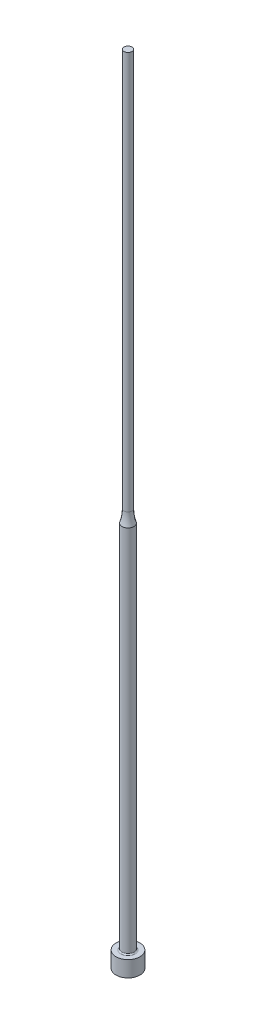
ISO-10303-21;
HEADER;
FILE_DESCRIPTION(('STEP AP214'),'2;1');
FILE_NAME('part.step','',(''),(''),'','','');
FILE_SCHEMA(('AUTOMOTIVE_DESIGN { 1 0 10303 214 1 1 1 1 }'));
ENDSEC;
DATA;
#1=APPLICATION_CONTEXT('core data for automotive mechanical design processes');
#2=APPLICATION_PROTOCOL_DEFINITION('international standard','automotive_design',2000,#1);
#3=PRODUCT_CONTEXT('',#1,'mechanical');
#4=PRODUCT('Part','Part','',(#3));
#5=PRODUCT_RELATED_PRODUCT_CATEGORY('part','',(#4));
#6=PRODUCT_DEFINITION_FORMATION('','',#4);
#7=PRODUCT_DEFINITION_CONTEXT('part definition',#1,'design');
#8=PRODUCT_DEFINITION('design','',#6,#7);
#9=PRODUCT_DEFINITION_SHAPE('','',#8);
#10=(LENGTH_UNIT() NAMED_UNIT(*) SI_UNIT(.MILLI.,.METRE.));
#11=(NAMED_UNIT(*) PLANE_ANGLE_UNIT() SI_UNIT($,.RADIAN.));
#12=(NAMED_UNIT(*) SI_UNIT($,.STERADIAN.) SOLID_ANGLE_UNIT());
#13=UNCERTAINTY_MEASURE_WITH_UNIT(LENGTH_MEASURE(1.E-05),#10,'distance_accuracy_value','');
#14=(GEOMETRIC_REPRESENTATION_CONTEXT(3) GLOBAL_UNCERTAINTY_ASSIGNED_CONTEXT((#13)) GLOBAL_UNIT_ASSIGNED_CONTEXT((#10,
#11,#12)) REPRESENTATION_CONTEXT('',''));
#15=CARTESIAN_POINT('',(0.,0.,0.));
#16=DIRECTION('',(0.,0.,1.));
#17=DIRECTION('',(1.,0.,0.));
#18=AXIS2_PLACEMENT_3D('',#15,#16,#17);
#19=CARTESIAN_POINT('',(1.00000000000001,200.,0.));
#20=DIRECTION('',(0.,-1.,0.));
#21=DIRECTION('',(1.,0.,0.));
#22=AXIS2_PLACEMENT_3D('',#19,#20,#21);
#23=PLANE('',#22);
#24=CARTESIAN_POINT('',(0.,200.,0.));
#25=DIRECTION('',(0.,1.,0.));
#26=DIRECTION('',(-1.,0.,0.));
#27=AXIS2_PLACEMENT_3D('',#24,#25,#26);
#28=CIRCLE('',#27,1.00000000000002);
#29=CARTESIAN_POINT('',(-1.00000000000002,200.,0.));
#30=VERTEX_POINT('',#29);
#31=EDGE_CURVE('E10',#30,#30,#28,.T.);
#32=ORIENTED_EDGE('',*,*,#31,.T.);
#33=EDGE_LOOP('',(#32));
#34=FACE_BOUND('',#33,.T.);
#35=ADVANCED_FACE('F30',(#34),#23,.F.);
#36=CARTESIAN_POINT('',(0.,200.,0.));
#37=DIRECTION('',(0.,1.,0.));
#38=DIRECTION('',(-1.,0.,0.));
#39=AXIS2_PLACEMENT_3D('',#36,#37,#38);
#40=CYLINDRICAL_SURFACE('',#39,1.00000000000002);
#41=ORIENTED_EDGE('',*,*,#31,.F.);
#42=EDGE_LOOP('',(#41));
#43=FACE_BOUND('',#42,.T.);
#44=CARTESIAN_POINT('',(0.,100.,0.));
#45=DIRECTION('',(0.,1.,0.));
#46=DIRECTION('',(-1.,0.,0.));
#47=AXIS2_PLACEMENT_3D('',#44,#45,#46);
#48=CIRCLE('',#47,1.00000000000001);
#49=CARTESIAN_POINT('',(-1.00000000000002,100.,0.));
#50=VERTEX_POINT('',#49);
#51=EDGE_CURVE('E36',#50,#50,#48,.T.);
#52=ORIENTED_EDGE('',*,*,#51,.T.);
#53=EDGE_LOOP('',(#52));
#54=FACE_BOUND('',#53,.T.);
#55=ADVANCED_FACE('F71',(#43,#54),#40,.T.);
#56=CARTESIAN_POINT('',(0.,100.,0.));
#57=DIRECTION('',(0.,1.,0.));
#58=DIRECTION('',(-1.,0.,0.));
#59=AXIS2_PLACEMENT_3D('',#56,#57,#58);
#60=TOROIDAL_SURFACE('',#59,11.,10.);
#61=ORIENTED_EDGE('',*,*,#51,.F.);
#62=EDGE_LOOP('',(#61));
#63=FACE_BOUND('',#62,.T.);
#64=CARTESIAN_POINT('',(0.,96.8775010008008,0.));
#65=DIRECTION('',(0.,1.,0.));
#66=DIRECTION('',(-1.,0.,0.));
#67=AXIS2_PLACEMENT_3D('',#64,#65,#66);
#68=CIRCLE('',#67,1.50000000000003);
#69=CARTESIAN_POINT('',(-1.50000000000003,96.8775010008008,0.));
#70=VERTEX_POINT('',#69);
#71=EDGE_CURVE('E40',#70,#70,#68,.T.);
#72=ORIENTED_EDGE('',*,*,#71,.T.);
#73=EDGE_LOOP('',(#72));
#74=FACE_BOUND('',#73,.T.);
#75=ADVANCED_FACE('F75',(#63,#74),#60,.F.);
#76=CARTESIAN_POINT('',(0.,200.,0.));
#77=DIRECTION('',(0.,1.,0.));
#78=DIRECTION('',(-1.,0.,0.));
#79=AXIS2_PLACEMENT_3D('',#76,#77,#78);
#80=CYLINDRICAL_SURFACE('',#79,1.50000000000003);
#81=ORIENTED_EDGE('',*,*,#71,.F.);
#82=EDGE_LOOP('',(#81));
#83=FACE_BOUND('',#82,.T.);
#84=CARTESIAN_POINT('',(0.,4.3,0.));
#85=DIRECTION('',(0.,1.,0.));
#86=DIRECTION('',(-1.,0.,0.));
#87=AXIS2_PLACEMENT_3D('',#84,#85,#86);
#88=CIRCLE('',#87,1.50000000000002);
#89=CARTESIAN_POINT('',(-1.50000000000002,4.3,0.));
#90=VERTEX_POINT('',#89);
#91=EDGE_CURVE('E44',#90,#90,#88,.T.);
#92=ORIENTED_EDGE('',*,*,#91,.T.);
#93=EDGE_LOOP('',(#92));
#94=FACE_BOUND('',#93,.T.);
#95=ADVANCED_FACE('F80',(#83,#94),#80,.T.);
#96=CARTESIAN_POINT('',(0.,4.3,0.));
#97=DIRECTION('',(0.,1.,0.));
#98=DIRECTION('',(-1.,0.,0.));
#99=AXIS2_PLACEMENT_3D('',#96,#97,#98);
#100=TOROIDAL_SURFACE('',#99,1.80000000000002,0.3);
#101=ORIENTED_EDGE('',*,*,#91,.F.);
#102=EDGE_LOOP('',(#101));
#103=FACE_BOUND('',#102,.T.);
#104=CARTESIAN_POINT('',(0.,4.,0.));
#105=DIRECTION('',(0.,1.,0.));
#106=DIRECTION('',(-1.,0.,0.));
#107=AXIS2_PLACEMENT_3D('',#104,#105,#106);
#108=CIRCLE('',#107,1.80000000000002);
#109=CARTESIAN_POINT('',(-1.80000000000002,4.,0.));
#110=VERTEX_POINT('',#109);
#111=EDGE_CURVE('E49',#110,#110,#108,.T.);
#112=ORIENTED_EDGE('',*,*,#111,.T.);
#113=EDGE_LOOP('',(#112));
#114=FACE_BOUND('',#113,.T.);
#115=ADVANCED_FACE('F86',(#103,#114),#100,.F.);
#116=CARTESIAN_POINT('',(3.00000000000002,4.,0.));
#117=DIRECTION('',(0.,-1.,0.));
#118=DIRECTION('',(1.,0.,0.));
#119=AXIS2_PLACEMENT_3D('',#116,#117,#118);
#120=PLANE('',#119);
#121=ORIENTED_EDGE('',*,*,#111,.F.);
#122=EDGE_LOOP('',(#121));
#123=FACE_BOUND('',#122,.T.);
#124=CARTESIAN_POINT('',(0.,4.,0.));
#125=DIRECTION('',(0.,1.,0.));
#126=DIRECTION('',(-1.,0.,0.));
#127=AXIS2_PLACEMENT_3D('',#124,#125,#126);
#128=CIRCLE('',#127,3.00000000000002);
#129=CARTESIAN_POINT('',(-3.00000000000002,4.,0.));
#130=VERTEX_POINT('',#129);
#131=EDGE_CURVE('E52',#130,#130,#128,.T.);
#132=ORIENTED_EDGE('',*,*,#131,.T.);
#133=EDGE_LOOP('',(#132));
#134=FACE_BOUND('',#133,.T.);
#135=ADVANCED_FACE('F67',(#123,#134),#120,.F.);
#136=CARTESIAN_POINT('',(0.,200.,0.));
#137=DIRECTION('',(0.,1.,0.));
#138=DIRECTION('',(-1.,0.,0.));
#139=AXIS2_PLACEMENT_3D('',#136,#137,#138);
#140=CYLINDRICAL_SURFACE('',#139,3.00000000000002);
#141=ORIENTED_EDGE('',*,*,#131,.F.);
#142=EDGE_LOOP('',(#141));
#143=FACE_BOUND('',#142,.T.);
#144=CARTESIAN_POINT('',(0.,0.,0.));
#145=DIRECTION('',(0.,1.,0.));
#146=DIRECTION('',(-1.,0.,0.));
#147=AXIS2_PLACEMENT_3D('',#144,#145,#146);
#148=CIRCLE('',#147,3.00000000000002);
#149=CARTESIAN_POINT('',(-3.00000000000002,0.,0.));
#150=VERTEX_POINT('',#149);
#151=EDGE_CURVE('E55',#150,#150,#148,.T.);
#152=ORIENTED_EDGE('',*,*,#151,.T.);
#153=EDGE_LOOP('',(#152));
#154=FACE_BOUND('',#153,.T.);
#155=ADVANCED_FACE('F59',(#143,#154),#140,.T.);
#156=CARTESIAN_POINT('',(0.,0.,0.));
#157=DIRECTION('',(0.,1.,0.));
#158=DIRECTION('',(-1.,0.,0.));
#159=AXIS2_PLACEMENT_3D('',#156,#157,#158);
#160=PLANE('',#159);
#161=ORIENTED_EDGE('',*,*,#151,.F.);
#162=EDGE_LOOP('',(#161));
#163=FACE_BOUND('',#162,.T.);
#164=ADVANCED_FACE('F61',(#163),#160,.F.);
#165=CLOSED_SHELL('',(#35,#55,#75,#95,#115,#135,#155,#164));
#166=MANIFOLD_SOLID_BREP('B2',#165);
#167=ADVANCED_BREP_SHAPE_REPRESENTATION('',(#18,#166),#14);
#168=SHAPE_DEFINITION_REPRESENTATION(#9,#167);
ENDSEC;
END-ISO-10303-21;
